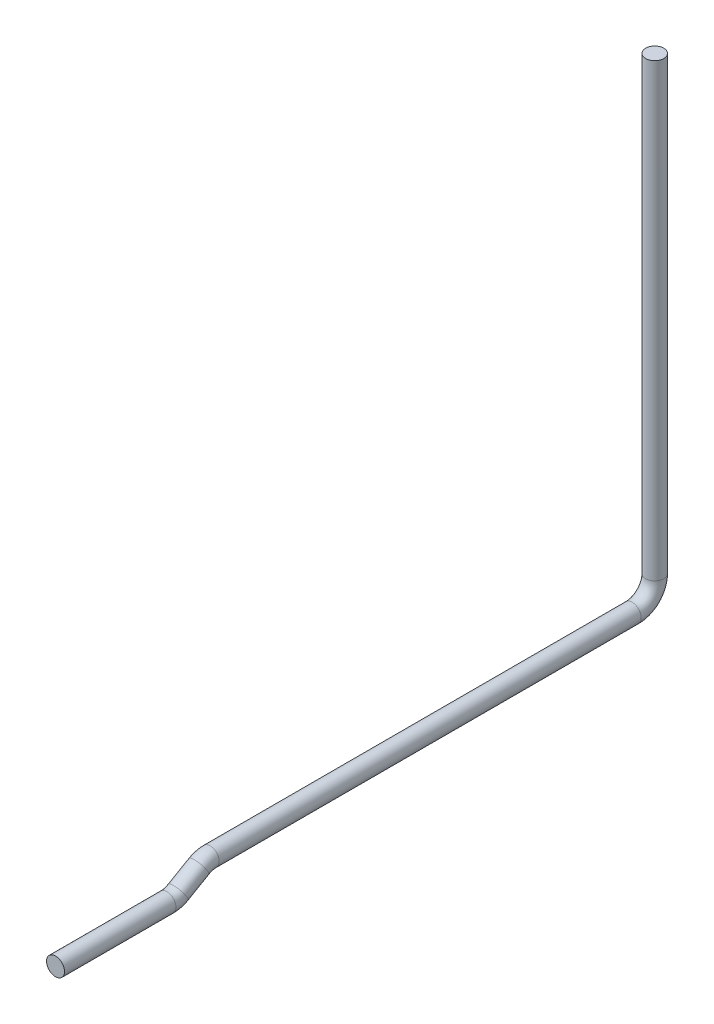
ISO-10303-21;
HEADER;
FILE_DESCRIPTION(('STEP AP214'),'2;1');
FILE_NAME('part.step','',(''),(''),'','','');
FILE_SCHEMA(('AUTOMOTIVE_DESIGN { 1 0 10303 214 1 1 1 1 }'));
ENDSEC;
DATA;
#1=APPLICATION_CONTEXT('core data for automotive mechanical design processes');
#2=APPLICATION_PROTOCOL_DEFINITION('international standard','automotive_design',2000,#1);
#3=PRODUCT_CONTEXT('',#1,'mechanical');
#4=PRODUCT('Part','Part','',(#3));
#5=PRODUCT_RELATED_PRODUCT_CATEGORY('part','',(#4));
#6=PRODUCT_DEFINITION_FORMATION('','',#4);
#7=PRODUCT_DEFINITION_CONTEXT('part definition',#1,'design');
#8=PRODUCT_DEFINITION('design','',#6,#7);
#9=PRODUCT_DEFINITION_SHAPE('','',#8);
#10=(LENGTH_UNIT() NAMED_UNIT(*) SI_UNIT(.MILLI.,.METRE.));
#11=(NAMED_UNIT(*) PLANE_ANGLE_UNIT() SI_UNIT($,.RADIAN.));
#12=(NAMED_UNIT(*) SI_UNIT($,.STERADIAN.) SOLID_ANGLE_UNIT());
#13=UNCERTAINTY_MEASURE_WITH_UNIT(LENGTH_MEASURE(1.E-05),#10,'distance_accuracy_value','');
#14=(GEOMETRIC_REPRESENTATION_CONTEXT(3) GLOBAL_UNCERTAINTY_ASSIGNED_CONTEXT((#13)) GLOBAL_UNIT_ASSIGNED_CONTEXT((#10,
#11,#12)) REPRESENTATION_CONTEXT('',''));
#15=CARTESIAN_POINT('',(0.,0.,0.));
#16=DIRECTION('',(0.,0.,1.));
#17=DIRECTION('',(1.,0.,0.));
#18=AXIS2_PLACEMENT_3D('',#15,#16,#17);
#19=CARTESIAN_POINT('',(0.,-110.999747,-23.0027448));
#20=DIRECTION('',(0.,0.,1.));
#21=DIRECTION('',(1.,0.,0.));
#22=AXIS2_PLACEMENT_3D('',#19,#20,#21);
#23=PLANE('',#22);
#24=CARTESIAN_POINT('',(0.,-110.999747,-23.0027448));
#25=DIRECTION('',(0.,0.,-1.));
#26=DIRECTION('',(-1.,0.,0.));
#27=AXIS2_PLACEMENT_3D('',#24,#25,#26);
#28=CIRCLE('',#27,2.);
#29=CARTESIAN_POINT('',(-2.,-110.999747,-23.0027448));
#30=VERTEX_POINT('',#29);
#31=EDGE_CURVE('E17',#30,#30,#28,.T.);
#32=ORIENTED_EDGE('',*,*,#31,.F.);
#33=EDGE_LOOP('',(#32));
#34=FACE_BOUND('',#33,.T.);
#35=ADVANCED_FACE('F14',(#34),#23,.T.);
#36=CARTESIAN_POINT('',(0.,-110.999747,-35.3677448));
#37=DIRECTION('',(0.,0.,-1.));
#38=DIRECTION('',(-1.,0.,0.));
#39=AXIS2_PLACEMENT_3D('',#36,#37,#38);
#40=CYLINDRICAL_SURFACE('',#39,2.);
#41=CARTESIAN_POINT('',(0.,-110.999747,-47.7327448));
#42=DIRECTION('',(0.,0.,-1.));
#43=DIRECTION('',(0.,-1.,0.));
#44=AXIS2_PLACEMENT_3D('',#41,#42,#43);
#45=CIRCLE('',#44,2.);
#46=CARTESIAN_POINT('',(0.,-112.999747,-47.7327448));
#47=VERTEX_POINT('',#46);
#48=EDGE_CURVE('E30',#47,#47,#45,.T.);
#49=ORIENTED_EDGE('',*,*,#48,.F.);
#50=EDGE_LOOP('',(#49));
#51=FACE_BOUND('',#50,.T.);
#52=ORIENTED_EDGE('',*,*,#31,.T.);
#53=EDGE_LOOP('',(#52));
#54=FACE_BOUND('',#53,.T.);
#55=ADVANCED_FACE('F42',(#51,#54),#40,.T.);
#56=CARTESIAN_POINT('',(0.,-105.999747,-47.7327448));
#57=DIRECTION('',(1.,0.,0.));
#58=DIRECTION('',(0.,0.,-1.));
#59=AXIS2_PLACEMENT_3D('',#56,#57,#58);
#60=TOROIDAL_SURFACE('',#59,5.,2.);
#61=ORIENTED_EDGE('',*,*,#48,.T.);
#62=EDGE_LOOP('',(#61));
#63=FACE_BOUND('',#62,.T.);
#64=CARTESIAN_POINT('',(0.,-110.329874,-50.2327448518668));
#65=DIRECTION('',(0.,0.500000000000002,-0.866025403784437));
#66=DIRECTION('',(0.,0.866025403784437,0.500000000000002));
#67=AXIS2_PLACEMENT_3D('',#64,#65,#66);
#68=CIRCLE('',#67,2.);
#69=CARTESIAN_POINT('',(0.,-108.597823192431,-49.2327448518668));
#70=VERTEX_POINT('',#69);
#71=EDGE_CURVE('E33',#70,#70,#68,.T.);
#72=ORIENTED_EDGE('',*,*,#71,.F.);
#73=EDGE_LOOP('',(#72));
#74=FACE_BOUND('',#73,.T.);
#75=ADVANCED_FACE('F38',(#63,#74),#60,.T.);
#76=CARTESIAN_POINT('',(0.,-108.999874,-52.5363724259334));
#77=DIRECTION('',(0.,0.500000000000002,-0.866025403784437));
#78=DIRECTION('',(0.,0.866025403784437,0.500000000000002));
#79=AXIS2_PLACEMENT_3D('',#76,#77,#78);
#80=CYLINDRICAL_SURFACE('',#79,2.);
#81=CARTESIAN_POINT('',(0.,-107.669872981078,-54.8400000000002));
#82=DIRECTION('',(0.,-0.499999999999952,0.866025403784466));
#83=DIRECTION('',(0.,0.866025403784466,0.499999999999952));
#84=AXIS2_PLACEMENT_3D('',#81,#82,#83);
#85=CIRCLE('',#84,2.);
#86=CARTESIAN_POINT('',(0.,-105.937822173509,-53.8400000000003));
#87=VERTEX_POINT('',#86);
#88=EDGE_CURVE('E84',#87,#87,#85,.F.);
#89=ORIENTED_EDGE('',*,*,#88,.F.);
#90=EDGE_LOOP('',(#89));
#91=FACE_BOUND('',#90,.T.);
#92=ORIENTED_EDGE('',*,*,#71,.T.);
#93=EDGE_LOOP('',(#92));
#94=FACE_BOUND('',#93,.T.);
#95=ADVANCED_FACE('F41',(#91,#94),#80,.T.);
#96=CARTESIAN_POINT('',(0.,-112.,-57.34));
#97=DIRECTION('',(1.,0.,0.));
#98=DIRECTION('',(0.,0.,-1.));
#99=AXIS2_PLACEMENT_3D('',#96,#97,#98);
#100=TOROIDAL_SURFACE('',#99,5.,2.);
#101=CARTESIAN_POINT('',(0.,-107.,-57.34));
#102=DIRECTION('',(0.,0.,-1.));
#103=DIRECTION('',(-1.,0.,0.));
#104=AXIS2_PLACEMENT_3D('',#101,#102,#103);
#105=CIRCLE('',#104,2.);
#106=CARTESIAN_POINT('',(-2.,-107.,-57.34));
#107=VERTEX_POINT('',#106);
#108=EDGE_CURVE('E79',#107,#107,#105,.T.);
#109=ORIENTED_EDGE('',*,*,#108,.F.);
#110=EDGE_LOOP('',(#109));
#111=FACE_BOUND('',#110,.T.);
#112=ORIENTED_EDGE('',*,*,#88,.T.);
#113=EDGE_LOOP('',(#112));
#114=FACE_BOUND('',#113,.T.);
#115=ADVANCED_FACE('F89',(#111,#114),#100,.T.);
#116=CARTESIAN_POINT('',(0.,-107.,-104.17));
#117=DIRECTION('',(0.,0.,-1.));
#118=DIRECTION('',(-1.,0.,0.));
#119=AXIS2_PLACEMENT_3D('',#116,#117,#118);
#120=CYLINDRICAL_SURFACE('',#119,2.);
#121=CARTESIAN_POINT('',(0.,-107.,-151.));
#122=DIRECTION('',(0.,0.,1.));
#123=DIRECTION('',(0.,-1.,0.));
#124=AXIS2_PLACEMENT_3D('',#121,#122,#123);
#125=CIRCLE('',#124,2.);
#126=CARTESIAN_POINT('',(0.,-109.,-151.));
#127=VERTEX_POINT('',#126);
#128=EDGE_CURVE('E25',#127,#127,#125,.F.);
#129=ORIENTED_EDGE('',*,*,#128,.F.);
#130=EDGE_LOOP('',(#129));
#131=FACE_BOUND('',#130,.T.);
#132=ORIENTED_EDGE('',*,*,#108,.T.);
#133=EDGE_LOOP('',(#132));
#134=FACE_BOUND('',#133,.T.);
#135=ADVANCED_FACE('F71',(#131,#134),#120,.T.);
#136=CARTESIAN_POINT('',(0.,-102.,-151.));
#137=DIRECTION('',(-1.,0.,0.));
#138=DIRECTION('',(0.,0.,1.));
#139=AXIS2_PLACEMENT_3D('',#136,#137,#138);
#140=TOROIDAL_SURFACE('',#139,5.,2.);
#141=CARTESIAN_POINT('',(0.,-102.,-156.));
#142=DIRECTION('',(0.,1.,0.));
#143=DIRECTION('',(0.,0.,1.));
#144=AXIS2_PLACEMENT_3D('',#141,#142,#143);
#145=CIRCLE('',#144,2.);
#146=CARTESIAN_POINT('',(0.,-102.,-154.));
#147=VERTEX_POINT('',#146);
#148=EDGE_CURVE('E21',#147,#147,#145,.T.);
#149=ORIENTED_EDGE('',*,*,#148,.F.);
#150=EDGE_LOOP('',(#149));
#151=FACE_BOUND('',#150,.T.);
#152=ORIENTED_EDGE('',*,*,#128,.T.);
#153=EDGE_LOOP('',(#152));
#154=FACE_BOUND('',#153,.T.);
#155=ADVANCED_FACE('F63',(#151,#154),#140,.T.);
#156=CARTESIAN_POINT('',(0.,-2.,-156.));
#157=DIRECTION('',(0.,1.,0.));
#158=DIRECTION('',(0.,0.,1.));
#159=AXIS2_PLACEMENT_3D('',#156,#157,#158);
#160=PLANE('',#159);
#161=CARTESIAN_POINT('',(0.,-2.,-156.));
#162=DIRECTION('',(0.,1.,0.));
#163=DIRECTION('',(0.,0.,1.));
#164=AXIS2_PLACEMENT_3D('',#161,#162,#163);
#165=CIRCLE('',#164,2.);
#166=CARTESIAN_POINT('',(0.,-2.,-154.));
#167=VERTEX_POINT('',#166);
#168=EDGE_CURVE('E10',#167,#167,#165,.F.);
#169=ORIENTED_EDGE('',*,*,#168,.F.);
#170=EDGE_LOOP('',(#169));
#171=FACE_BOUND('',#170,.T.);
#172=ADVANCED_FACE('F57',(#171),#160,.T.);
#173=CARTESIAN_POINT('',(0.,-52.,-156.));
#174=DIRECTION('',(0.,1.,0.));
#175=DIRECTION('',(0.,0.,1.));
#176=AXIS2_PLACEMENT_3D('',#173,#174,#175);
#177=CYLINDRICAL_SURFACE('',#176,2.);
#178=ORIENTED_EDGE('',*,*,#168,.T.);
#179=EDGE_LOOP('',(#178));
#180=FACE_BOUND('',#179,.T.);
#181=ORIENTED_EDGE('',*,*,#148,.T.);
#182=EDGE_LOOP('',(#181));
#183=FACE_BOUND('',#182,.T.);
#184=ADVANCED_FACE('F55',(#180,#183),#177,.T.);
#185=CLOSED_SHELL('',(#35,#55,#75,#95,#115,#135,#155,#172,#184));
#186=MANIFOLD_SOLID_BREP('B1',#185);
#187=ADVANCED_BREP_SHAPE_REPRESENTATION('',(#18,#186),#14);
#188=SHAPE_DEFINITION_REPRESENTATION(#9,#187);
ENDSEC;
END-ISO-10303-21;
